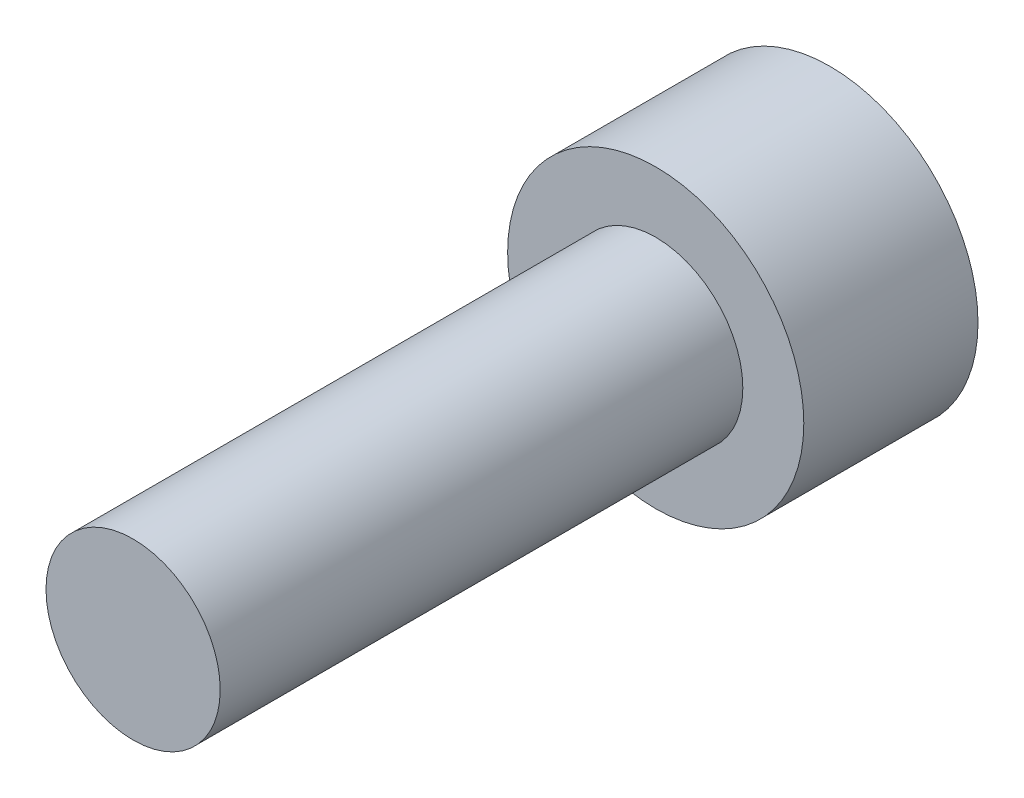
ISO-10303-21;
HEADER;
FILE_DESCRIPTION(('STEP AP214'),'2;1');
FILE_NAME('part.step','',(''),(''),'','','');
FILE_SCHEMA(('AUTOMOTIVE_DESIGN { 1 0 10303 214 1 1 1 1 }'));
ENDSEC;
DATA;
#1=APPLICATION_CONTEXT('core data for automotive mechanical design processes');
#2=APPLICATION_PROTOCOL_DEFINITION('international standard','automotive_design',2000,#1);
#3=PRODUCT_CONTEXT('',#1,'mechanical');
#4=PRODUCT('Part','Part','',(#3));
#5=PRODUCT_RELATED_PRODUCT_CATEGORY('part','',(#4));
#6=PRODUCT_DEFINITION_FORMATION('','',#4);
#7=PRODUCT_DEFINITION_CONTEXT('part definition',#1,'design');
#8=PRODUCT_DEFINITION('design','',#6,#7);
#9=PRODUCT_DEFINITION_SHAPE('','',#8);
#10=(LENGTH_UNIT() NAMED_UNIT(*) SI_UNIT(.MILLI.,.METRE.));
#11=(NAMED_UNIT(*) PLANE_ANGLE_UNIT() SI_UNIT($,.RADIAN.));
#12=(NAMED_UNIT(*) SI_UNIT($,.STERADIAN.) SOLID_ANGLE_UNIT());
#13=UNCERTAINTY_MEASURE_WITH_UNIT(LENGTH_MEASURE(1.E-05),#10,'distance_accuracy_value','');
#14=(GEOMETRIC_REPRESENTATION_CONTEXT(3) GLOBAL_UNCERTAINTY_ASSIGNED_CONTEXT((#13)) GLOBAL_UNIT_ASSIGNED_CONTEXT((#10,
#11,#12)) REPRESENTATION_CONTEXT('',''));
#15=CARTESIAN_POINT('',(0.,0.,0.));
#16=DIRECTION('',(0.,0.,1.));
#17=DIRECTION('',(1.,0.,0.));
#18=AXIS2_PLACEMENT_3D('',#15,#16,#17);
#19=CARTESIAN_POINT('',(0.,0.,15.));
#20=DIRECTION('',(0.,0.,1.));
#21=DIRECTION('',(1.,0.,0.));
#22=AXIS2_PLACEMENT_3D('',#19,#20,#21);
#23=PLANE('',#22);
#24=CARTESIAN_POINT('',(0.,0.,15.));
#25=DIRECTION('',(0.,0.,1.));
#26=DIRECTION('',(1.,0.,0.));
#27=AXIS2_PLACEMENT_3D('',#24,#25,#26);
#28=CIRCLE('',#27,2.5);
#29=CARTESIAN_POINT('',(2.5,0.,15.));
#30=VERTEX_POINT('',#29);
#31=EDGE_CURVE('E11',#30,#30,#28,.T.);
#32=ORIENTED_EDGE('',*,*,#31,.T.);
#33=EDGE_LOOP('',(#32));
#34=FACE_BOUND('',#33,.T.);
#35=ADVANCED_FACE('F32',(#34),#23,.T.);
#36=CARTESIAN_POINT('',(0.,0.,15.));
#37=DIRECTION('',(0.,0.,1.));
#38=DIRECTION('',(1.,0.,0.));
#39=AXIS2_PLACEMENT_3D('',#36,#37,#38);
#40=CYLINDRICAL_SURFACE('',#39,2.5);
#41=CARTESIAN_POINT('',(0.,0.,0.));
#42=DIRECTION('',(0.,0.,1.));
#43=DIRECTION('',(1.,0.,0.));
#44=AXIS2_PLACEMENT_3D('',#41,#42,#43);
#45=CIRCLE('',#44,2.5);
#46=CARTESIAN_POINT('',(2.5,0.,0.));
#47=VERTEX_POINT('',#46);
#48=EDGE_CURVE('E39',#47,#47,#45,.T.);
#49=ORIENTED_EDGE('',*,*,#48,.T.);
#50=EDGE_LOOP('',(#49));
#51=FACE_BOUND('',#50,.T.);
#52=ORIENTED_EDGE('',*,*,#31,.F.);
#53=EDGE_LOOP('',(#52));
#54=FACE_BOUND('',#53,.T.);
#55=ADVANCED_FACE('F146',(#51,#54),#40,.T.);
#56=CARTESIAN_POINT('',(0.,-2.5,0.));
#57=DIRECTION('',(0.,0.,1.));
#58=DIRECTION('',(1.,0.,0.));
#59=AXIS2_PLACEMENT_3D('',#56,#57,#58);
#60=PLANE('',#59);
#61=CARTESIAN_POINT('',(0.,0.,0.));
#62=DIRECTION('',(0.,0.,1.));
#63=DIRECTION('',(1.,0.,0.));
#64=AXIS2_PLACEMENT_3D('',#61,#62,#63);
#65=CIRCLE('',#64,4.25);
#66=CARTESIAN_POINT('',(4.25,0.,0.));
#67=VERTEX_POINT('',#66);
#68=EDGE_CURVE('E141',#67,#67,#65,.T.);
#69=ORIENTED_EDGE('',*,*,#68,.T.);
#70=EDGE_LOOP('',(#69));
#71=FACE_BOUND('',#70,.T.);
#72=ORIENTED_EDGE('',*,*,#48,.F.);
#73=EDGE_LOOP('',(#72));
#74=FACE_BOUND('',#73,.T.);
#75=ADVANCED_FACE('F149',(#71,#74),#60,.T.);
#76=CARTESIAN_POINT('',(0.,0.,15.));
#77=DIRECTION('',(0.,0.,1.));
#78=DIRECTION('',(1.,0.,0.));
#79=AXIS2_PLACEMENT_3D('',#76,#77,#78);
#80=CYLINDRICAL_SURFACE('',#79,4.25);
#81=CARTESIAN_POINT('',(0.,0.,-5.));
#82=DIRECTION('',(0.,0.,1.));
#83=DIRECTION('',(1.,0.,0.));
#84=AXIS2_PLACEMENT_3D('',#81,#82,#83);
#85=CIRCLE('',#84,4.25);
#86=CARTESIAN_POINT('',(4.25,0.,-5.));
#87=VERTEX_POINT('',#86);
#88=EDGE_CURVE('E133',#87,#87,#85,.T.);
#89=ORIENTED_EDGE('',*,*,#88,.T.);
#90=EDGE_LOOP('',(#89));
#91=FACE_BOUND('',#90,.T.);
#92=ORIENTED_EDGE('',*,*,#68,.F.);
#93=EDGE_LOOP('',(#92));
#94=FACE_BOUND('',#93,.T.);
#95=ADVANCED_FACE('F151',(#91,#94),#80,.T.);
#96=CARTESIAN_POINT('',(0.,-4.25,-5.));
#97=DIRECTION('',(0.,0.,-1.));
#98=DIRECTION('',(-1.,0.,0.));
#99=AXIS2_PLACEMENT_3D('',#96,#97,#98);
#100=PLANE('',#99);
#101=DIRECTION('',(0.866025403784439,-0.5,0.));
#102=VECTOR('',#101,1.);
#103=CARTESIAN_POINT('',(0.,2.3094010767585,-5.));
#104=LINE('',#103,#102);
#105=CARTESIAN_POINT('',(0.,2.3094010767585,-5.));
#106=VERTEX_POINT('',#105);
#107=CARTESIAN_POINT('',(2.,1.15470053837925,-5.));
#108=VERTEX_POINT('',#107);
#109=EDGE_CURVE('E46',#106,#108,#104,.T.);
#110=ORIENTED_EDGE('',*,*,#109,.F.);
#111=DIRECTION('',(0.866025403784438,0.5,0.));
#112=VECTOR('',#111,1.);
#113=CARTESIAN_POINT('',(-2.,1.15470053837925,-5.));
#114=LINE('',#113,#112);
#115=CARTESIAN_POINT('',(-2.,1.15470053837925,-5.));
#116=VERTEX_POINT('',#115);
#117=EDGE_CURVE('E129',#116,#106,#114,.T.);
#118=ORIENTED_EDGE('',*,*,#117,.F.);
#119=DIRECTION('',(0.,1.,0.));
#120=VECTOR('',#119,1.);
#121=CARTESIAN_POINT('',(-2.,-1.15470053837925,-5.));
#122=LINE('',#121,#120);
#123=CARTESIAN_POINT('',(-2.,-1.15470053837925,-5.));
#124=VERTEX_POINT('',#123);
#125=EDGE_CURVE('E127',#124,#116,#122,.T.);
#126=ORIENTED_EDGE('',*,*,#125,.F.);
#127=DIRECTION('',(-0.866025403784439,0.5,0.));
#128=VECTOR('',#127,1.);
#129=CARTESIAN_POINT('',(0.,-2.3094010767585,-5.));
#130=LINE('',#129,#128);
#131=CARTESIAN_POINT('',(0.,-2.3094010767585,-5.));
#132=VERTEX_POINT('',#131);
#133=EDGE_CURVE('E94',#132,#124,#130,.T.);
#134=ORIENTED_EDGE('',*,*,#133,.F.);
#135=DIRECTION('',(-0.866025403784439,-0.5,0.));
#136=VECTOR('',#135,1.);
#137=CARTESIAN_POINT('',(2.,-1.15470053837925,-5.));
#138=LINE('',#137,#136);
#139=CARTESIAN_POINT('',(2.,-1.15470053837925,-5.));
#140=VERTEX_POINT('',#139);
#141=EDGE_CURVE('E123',#140,#132,#138,.T.);
#142=ORIENTED_EDGE('',*,*,#141,.F.);
#143=DIRECTION('',(0.,-1.,0.));
#144=VECTOR('',#143,1.);
#145=CARTESIAN_POINT('',(2.,1.15470053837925,-5.));
#146=LINE('',#145,#144);
#147=EDGE_CURVE('E120',#108,#140,#146,.T.);
#148=ORIENTED_EDGE('',*,*,#147,.F.);
#149=EDGE_LOOP('',(#110,#118,#126,#134,#142,#148));
#150=FACE_BOUND('',#149,.T.);
#151=ORIENTED_EDGE('',*,*,#88,.F.);
#152=EDGE_LOOP('',(#151));
#153=FACE_BOUND('',#152,.T.);
#154=ADVANCED_FACE('F158',(#150,#153),#100,.T.);
#155=CARTESIAN_POINT('',(0.,2.3094010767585,-0.999999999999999));
#156=DIRECTION('',(0.5,0.866025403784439,0.));
#157=DIRECTION('',(-0.866025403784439,0.5,0.));
#158=AXIS2_PLACEMENT_3D('',#155,#156,#157);
#159=PLANE('',#158);
#160=ORIENTED_EDGE('',*,*,#109,.T.);
#161=DIRECTION('',(0.,0.,-1.));
#162=VECTOR('',#161,1.);
#163=CARTESIAN_POINT('',(2.,1.15470053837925,-0.999999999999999));
#164=LINE('',#163,#162);
#165=CARTESIAN_POINT('',(2.,1.15470053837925,-0.999999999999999));
#166=VERTEX_POINT('',#165);
#167=EDGE_CURVE('E76',#166,#108,#164,.T.);
#168=ORIENTED_EDGE('',*,*,#167,.F.);
#169=DIRECTION('',(0.866025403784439,-0.5,0.));
#170=VECTOR('',#169,1.);
#171=CARTESIAN_POINT('',(0.,2.3094010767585,-0.999999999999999));
#172=LINE('',#171,#170);
#173=CARTESIAN_POINT('',(0.,2.3094010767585,-0.999999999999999));
#174=VERTEX_POINT('',#173);
#175=EDGE_CURVE('E131',#174,#166,#172,.T.);
#176=ORIENTED_EDGE('',*,*,#175,.F.);
#177=DIRECTION('',(0.,0.,-1.));
#178=VECTOR('',#177,1.);
#179=CARTESIAN_POINT('',(0.,2.3094010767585,-0.999999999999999));
#180=LINE('',#179,#178);
#181=EDGE_CURVE('E54',#174,#106,#180,.T.);
#182=ORIENTED_EDGE('',*,*,#181,.T.);
#183=EDGE_LOOP('',(#160,#168,#176,#182));
#184=FACE_BOUND('',#183,.T.);
#185=ADVANCED_FACE('F189',(#184),#159,.F.);
#186=CARTESIAN_POINT('',(-2.,1.15470053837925,-0.999999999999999));
#187=DIRECTION('',(-0.5,0.866025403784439,0.));
#188=DIRECTION('',(-0.866025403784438,-0.5,0.));
#189=AXIS2_PLACEMENT_3D('',#186,#187,#188);
#190=PLANE('',#189);
#191=ORIENTED_EDGE('',*,*,#117,.T.);
#192=ORIENTED_EDGE('',*,*,#181,.F.);
#193=DIRECTION('',(0.866025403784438,0.5,0.));
#194=VECTOR('',#193,1.);
#195=CARTESIAN_POINT('',(-2.,1.15470053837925,-0.999999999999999));
#196=LINE('',#195,#194);
#197=CARTESIAN_POINT('',(-2.,1.15470053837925,-0.999999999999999));
#198=VERTEX_POINT('',#197);
#199=EDGE_CURVE('E106',#198,#174,#196,.T.);
#200=ORIENTED_EDGE('',*,*,#199,.F.);
#201=DIRECTION('',(0.,0.,-1.));
#202=VECTOR('',#201,1.);
#203=CARTESIAN_POINT('',(-2.,1.15470053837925,-0.999999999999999));
#204=LINE('',#203,#202);
#205=EDGE_CURVE('E98',#198,#116,#204,.T.);
#206=ORIENTED_EDGE('',*,*,#205,.T.);
#207=EDGE_LOOP('',(#191,#192,#200,#206));
#208=FACE_BOUND('',#207,.T.);
#209=ADVANCED_FACE('F199',(#208),#190,.F.);
#210=CARTESIAN_POINT('',(-2.,-1.15470053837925,-0.999999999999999));
#211=DIRECTION('',(-1.,0.,0.));
#212=DIRECTION('',(0.,-1.,0.));
#213=AXIS2_PLACEMENT_3D('',#210,#211,#212);
#214=PLANE('',#213);
#215=ORIENTED_EDGE('',*,*,#125,.T.);
#216=ORIENTED_EDGE('',*,*,#205,.F.);
#217=DIRECTION('',(0.,1.,0.));
#218=VECTOR('',#217,1.);
#219=CARTESIAN_POINT('',(-2.,-1.15470053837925,-0.999999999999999));
#220=LINE('',#219,#218);
#221=CARTESIAN_POINT('',(-2.,-1.15470053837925,-0.999999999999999));
#222=VERTEX_POINT('',#221);
#223=EDGE_CURVE('E102',#222,#198,#220,.T.);
#224=ORIENTED_EDGE('',*,*,#223,.F.);
#225=DIRECTION('',(0.,0.,-1.));
#226=VECTOR('',#225,1.);
#227=CARTESIAN_POINT('',(-2.,-1.15470053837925,-0.999999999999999));
#228=LINE('',#227,#226);
#229=EDGE_CURVE('E87',#222,#124,#228,.T.);
#230=ORIENTED_EDGE('',*,*,#229,.T.);
#231=EDGE_LOOP('',(#215,#216,#224,#230));
#232=FACE_BOUND('',#231,.T.);
#233=ADVANCED_FACE('F103',(#232),#214,.F.);
#234=CARTESIAN_POINT('',(0.,-2.3094010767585,-0.999999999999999));
#235=DIRECTION('',(-0.5,-0.866025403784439,0.));
#236=DIRECTION('',(0.866025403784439,-0.5,0.));
#237=AXIS2_PLACEMENT_3D('',#234,#235,#236);
#238=PLANE('',#237);
#239=ORIENTED_EDGE('',*,*,#133,.T.);
#240=ORIENTED_EDGE('',*,*,#229,.F.);
#241=DIRECTION('',(-0.866025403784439,0.5,0.));
#242=VECTOR('',#241,1.);
#243=CARTESIAN_POINT('',(0.,-2.3094010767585,-0.999999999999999));
#244=LINE('',#243,#242);
#245=CARTESIAN_POINT('',(0.,-2.3094010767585,-0.999999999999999));
#246=VERTEX_POINT('',#245);
#247=EDGE_CURVE('E91',#246,#222,#244,.T.);
#248=ORIENTED_EDGE('',*,*,#247,.F.);
#249=DIRECTION('',(0.,0.,-1.));
#250=VECTOR('',#249,1.);
#251=CARTESIAN_POINT('',(0.,-2.3094010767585,-0.999999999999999));
#252=LINE('',#251,#250);
#253=EDGE_CURVE('E99',#246,#132,#252,.T.);
#254=ORIENTED_EDGE('',*,*,#253,.T.);
#255=EDGE_LOOP('',(#239,#240,#248,#254));
#256=FACE_BOUND('',#255,.T.);
#257=ADVANCED_FACE('F89',(#256),#238,.F.);
#258=CARTESIAN_POINT('',(2.,-1.15470053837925,-0.999999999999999));
#259=DIRECTION('',(0.5,-0.866025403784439,0.));
#260=DIRECTION('',(0.866025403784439,0.5,0.));
#261=AXIS2_PLACEMENT_3D('',#258,#259,#260);
#262=PLANE('',#261);
#263=ORIENTED_EDGE('',*,*,#141,.T.);
#264=ORIENTED_EDGE('',*,*,#253,.F.);
#265=DIRECTION('',(-0.866025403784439,-0.5,0.));
#266=VECTOR('',#265,1.);
#267=CARTESIAN_POINT('',(2.,-1.15470053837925,-0.999999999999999));
#268=LINE('',#267,#266);
#269=CARTESIAN_POINT('',(2.,-1.15470053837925,-0.999999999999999));
#270=VERTEX_POINT('',#269);
#271=EDGE_CURVE('E112',#270,#246,#268,.T.);
#272=ORIENTED_EDGE('',*,*,#271,.F.);
#273=DIRECTION('',(0.,0.,-1.));
#274=VECTOR('',#273,1.);
#275=CARTESIAN_POINT('',(2.,-1.15470053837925,-0.999999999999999));
#276=LINE('',#275,#274);
#277=EDGE_CURVE('E136',#270,#140,#276,.T.);
#278=ORIENTED_EDGE('',*,*,#277,.T.);
#279=EDGE_LOOP('',(#263,#264,#272,#278));
#280=FACE_BOUND('',#279,.T.);
#281=ADVANCED_FACE('F224',(#280),#262,.F.);
#282=CARTESIAN_POINT('',(2.,1.15470053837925,-0.999999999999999));
#283=DIRECTION('',(1.,0.,0.));
#284=DIRECTION('',(0.,0.,-1.));
#285=AXIS2_PLACEMENT_3D('',#282,#283,#284);
#286=PLANE('',#285);
#287=ORIENTED_EDGE('',*,*,#147,.T.);
#288=ORIENTED_EDGE('',*,*,#277,.F.);
#289=DIRECTION('',(0.,-1.,0.));
#290=VECTOR('',#289,1.);
#291=CARTESIAN_POINT('',(2.,1.15470053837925,-0.999999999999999));
#292=LINE('',#291,#290);
#293=EDGE_CURVE('E114',#166,#270,#292,.T.);
#294=ORIENTED_EDGE('',*,*,#293,.F.);
#295=ORIENTED_EDGE('',*,*,#167,.T.);
#296=EDGE_LOOP('',(#287,#288,#294,#295));
#297=FACE_BOUND('',#296,.T.);
#298=ADVANCED_FACE('F233',(#297),#286,.F.);
#299=CARTESIAN_POINT('',(0.,2.3094010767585,-0.999999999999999));
#300=DIRECTION('',(0.,0.,1.));
#301=DIRECTION('',(1.,0.,0.));
#302=AXIS2_PLACEMENT_3D('',#299,#300,#301);
#303=PLANE('',#302);
#304=ORIENTED_EDGE('',*,*,#175,.T.);
#305=ORIENTED_EDGE('',*,*,#293,.T.);
#306=ORIENTED_EDGE('',*,*,#271,.T.);
#307=ORIENTED_EDGE('',*,*,#247,.T.);
#308=ORIENTED_EDGE('',*,*,#223,.T.);
#309=ORIENTED_EDGE('',*,*,#199,.T.);
#310=EDGE_LOOP('',(#304,#305,#306,#307,#308,#309));
#311=FACE_BOUND('',#310,.T.);
#312=ADVANCED_FACE('F109',(#311),#303,.F.);
#313=CLOSED_SHELL('',(#35,#55,#75,#95,#154,#185,#209,#233,#257,#281,#298,#312));
#314=MANIFOLD_SOLID_BREP('B2',#313);
#315=ADVANCED_BREP_SHAPE_REPRESENTATION('',(#18,#314),#14);
#316=SHAPE_DEFINITION_REPRESENTATION(#9,#315);
ENDSEC;
END-ISO-10303-21;
